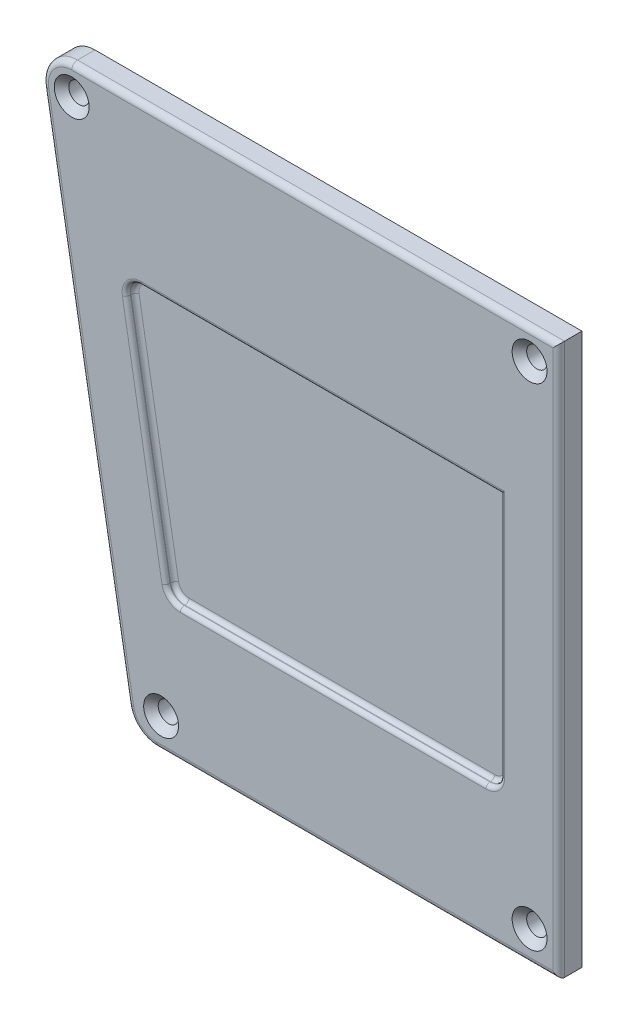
from build123d import *

# Parameters (mm, degrees)
ESQUISSE1_R                       = 3.5
BASE_EXTRUSION_DEPTH              = 8
CONG_1_R                          = 2
ENL_V_MAT_EXTRU_1_DEPTH           = 3
CONG_2_R                          = 1.4
ENL_V_MAT_EXTRU_2_DEPTH           = 3
CONG_3_R                          = 2
ESQUISSE4_R                       = 6
ENL_V_MAT_EXTRU_3_DEPTH           = 3
ENL_V_MAT_EXTRU_3_DRAFT           = -45
ENL_V_MAT_EXTRU_3_PROFILE_2_DEPTH = 3
ENL_V_MAT_EXTRU_3_PROFILE_2_DRAFT = -45
ENL_V_MAT_EXTRU_3_PROFILE_3_DEPTH = 3
ENL_V_MAT_EXTRU_3_PROFILE_3_DRAFT = -45
ENL_V_MAT_EXTRU_3_PROFILE_4_DEPTH = 3
ENL_V_MAT_EXTRU_3_PROFILE_4_DRAFT = -45


with BuildPart() as part:
    # Esquisse1 → Base-Extrusion (new body)
    with BuildSketch(Plane.XY):
        with BuildLine():
            Line((23.333648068, -2), (-114.890913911, -2))
            ThreePointArc((-114.890913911, -2), (-121.334233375, 0.352540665), (-124.745918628, 6.303273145))
            Line((-124.745918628, 6.303273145), (-153.91135665, 175.703273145))
            ThreePointArc((-153.91135665, 175.703273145), (-151.703811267, 183.843319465), (-144.056351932, 187.4))
            Line((-144.056351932, 187.4), (23.333648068, 187.4))
            Line((23.333648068, 187.4), (23.333648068, -2))
        make_face()
        with Locations((13.333648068, 8.49)):
            Circle(ESQUISSE1_R, mode=Mode.SUBTRACT)
        with Locations((-144.056351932, 177.4)):
            Circle(ESQUISSE1_R, mode=Mode.SUBTRACT)
        with Locations((-113.316351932, 8.49)):
            Circle(ESQUISSE1_R, mode=Mode.SUBTRACT)
        with Locations((13.333648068, 177.4)):
            Circle(ESQUISSE1_R, mode=Mode.SUBTRACT)
    extrude(amount=BASE_EXTRUSION_DEPTH)

    # Cong_1
    cong_1_edges = [part.edges().sort_by_distance(p)[0] for p in [
        (-151.703811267, 183.843319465, 8),
        (-139.328637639, 91.003273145, 8),
        (-121.334233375, 0.352540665, 8),
        (-45.778632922, -2, 8),
        (23.333648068, 92.7, 8),
        (-60.361351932, 187.4, 8),
    ]]
    fillet(cong_1_edges, radius=CONG_1_R)

    # Esquisse2 → Enl_v. mat.-Extru.1 (cut)
    with BuildSketch(Plane.XY.offset(8)):
        with BuildLine():
            Line((-106.729152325, 44), (-1.666351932, 44))
            ThreePointArc((-1.666351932, 44), (1.869181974, 45.464466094), (3.333648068, 49))
            Line((3.333648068, 49), (3.333648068, 133))
            Line((3.333648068, 133), (-120.330507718, 133))
            ThreePointArc((-120.330507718, 133), (-124.154237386, 131.221659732), (-125.258010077, 127.151636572))
            Line((-125.258010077, 127.151636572), (-111.656654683, 48.151636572))
            ThreePointArc((-111.656654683, 48.151636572), (-109.950812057, 45.176270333), (-106.729152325, 44))
        make_face()
    extrude(amount=-ENL_V_MAT_EXTRU_1_DEPTH, mode=Mode.SUBTRACT)

    # Cong_2
    cong_2_edges = [part.edges().sort_by_distance(p)[0] for p in [
        (3.333648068, 91, 5),
        (1.869181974, 45.464466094, 5),
        (-54.197752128, 44, 5),
        (-109.950812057, 45.176270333, 5),
        (-118.45733238, 87.651636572, 5),
        (-124.154237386, 131.221659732, 5),
        (-58.498429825, 133, 5),
        (3.333648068, 91, 8),
        (-58.498429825, 133, 8),
        (-124.154237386, 131.221659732, 8),
        (-118.45733238, 87.651636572, 8),
        (-109.950812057, 45.176270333, 8),
        (-54.197752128, 44, 8),
        (1.869181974, 45.464466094, 8),
    ]]
    fillet(cong_2_edges, radius=CONG_2_R)

    # Esquisse3 → Enl_v. mat.-Extru.2 (cut)
    with BuildSketch(Plane(origin=(0, 0, 0), x_dir=(-1, 0, 0), z_dir=(0, 0, -1))):
        with BuildLine():
            Line((1.666351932, 37), (96.951822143, 37))
            ThreePointArc((96.951822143, 37), (100.487356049, 35.535533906), (101.951822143, 32))
            Line((101.951822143, 32), (101.951822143, 14.433141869))
            ThreePointArc((101.951822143, 14.433141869), (100.487356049, 10.897607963), (96.951822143, 9.433141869))
            Line((96.951822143, 9.433141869), (1.666351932, 9.433141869))
            ThreePointArc((1.666351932, 9.433141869), (-1.869181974, 10.897607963), (-3.333648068, 14.433141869))
            Line((-3.333648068, 14.433141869), (-3.333648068, 32))
            ThreePointArc((-3.333648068, 32), (-1.869181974, 35.535533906), (1.666351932, 37))
        make_face()
        with BuildLine():
            Line((1.666351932, 167.548258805), (121.524693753, 167.548258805))
            ThreePointArc((121.524693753, 167.548258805), (125.060227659, 166.083792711), (126.524693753, 162.548258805))
            Line((126.524693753, 162.548258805), (126.524693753, 145))
            ThreePointArc((126.524693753, 145), (125.060227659, 141.464466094), (121.524693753, 140))
            Line((121.524693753, 140), (1.666351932, 140))
            ThreePointArc((1.666351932, 140), (-1.869181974, 141.464466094), (-3.333648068, 145))
            Line((-3.333648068, 145), (-3.333648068, 162.548258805))
            ThreePointArc((-3.333648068, 162.548258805), (-1.869181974, 166.083792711), (1.666351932, 167.548258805))
        make_face()
    extrude(amount=-ENL_V_MAT_EXTRU_2_DEPTH, mode=Mode.SUBTRACT)

    # Cong_3
    cong_3_edges = [part.edges().sort_by_distance(p)[0] for p in [
        (-125.060227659, 166.083792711, 3),
        (-126.524693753, 153.774129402, 3),
        (-125.060227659, 141.464466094, 3),
        (-61.595522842, 140, 3),
        (1.869181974, 141.464466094, 3),
        (3.333648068, 153.774129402, 3),
        (1.869181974, 166.083792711, 3),
        (-61.595522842, 167.548258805, 3),
        (-100.487356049, 35.535533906, 3),
        (-101.951822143, 23.216570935, 3),
        (-100.487356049, 10.897607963, 3),
        (-49.309087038, 9.433141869, 3),
        (1.869181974, 10.897607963, 3),
        (3.333648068, 23.216570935, 3),
        (1.869181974, 35.535533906, 3),
        (-49.309087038, 37, 3),
    ]]
    fillet(cong_3_edges, radius=CONG_3_R)


with BuildPart() as enl_v_mat_extru_3_tool:
    # Esquisse4 → Enl_v. mat.-Extru.3 (with draft: the straight prism first)
    with BuildSketch(Plane.XY.offset(8)):
        with Locations((-144.056351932, 177.4)):
            Circle(ESQUISSE4_R)
    extrude(amount=-ENL_V_MAT_EXTRU_3_DEPTH)
    # Enl_v. mat.-Extru.3: the draft: its side faces are tilted about the plane it starts from
    enl_v_mat_extru_3_sides = [enl_v_mat_extru_3_tool.faces().sort_by_distance(p)[0] for p in [
        (-150.056351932, 177.4, 6.5),
    ]]
    draft(enl_v_mat_extru_3_sides, Plane.XY.offset(8), ENL_V_MAT_EXTRU_3_DRAFT)


with BuildPart() as part_1:
    add(part.part)

    # Enl_v. mat.-Extru.3: cut by enl_v_mat_extru_3_tool
    add(enl_v_mat_extru_3_tool.part, mode=Mode.SUBTRACT)


with BuildPart() as enl_v_mat_extru_3_profile_2_tool:
    # Esquisse4 → Enl_v. mat.-Extru.3 profile 2 (with draft: the straight prism first)
    with BuildSketch(Plane.XY.offset(8)):
        with Locations((13.333648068, 177.4)):
            Circle(ESQUISSE4_R)
    extrude(amount=-ENL_V_MAT_EXTRU_3_PROFILE_2_DEPTH)
    # Enl_v. mat.-Extru.3 profile 2: the draft: its side faces are tilted about the plane it starts from
    enl_v_mat_extru_3_profile_2_sides = [enl_v_mat_extru_3_profile_2_tool.faces().sort_by_distance(p)[0] for p in [
        (7.333648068, 177.4, 6.5),
    ]]
    draft(enl_v_mat_extru_3_profile_2_sides, Plane.XY.offset(8), ENL_V_MAT_EXTRU_3_PROFILE_2_DRAFT)


with BuildPart() as part_2:
    add(part_1.part)

    # Enl_v. mat.-Extru.3 profile 2: cut by enl_v_mat_extru_3_profile_2_tool
    add(enl_v_mat_extru_3_profile_2_tool.part, mode=Mode.SUBTRACT)


with BuildPart() as enl_v_mat_extru_3_profile_3_tool:
    # Esquisse4 → Enl_v. mat.-Extru.3 profile 3 (with draft: the straight prism first)
    with BuildSketch(Plane.XY.offset(8)):
        with Locations((13.333648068, 8.49)):
            Circle(ESQUISSE4_R)
    extrude(amount=-ENL_V_MAT_EXTRU_3_PROFILE_3_DEPTH)
    # Enl_v. mat.-Extru.3 profile 3: the draft: its side faces are tilted about the plane it starts from
    enl_v_mat_extru_3_profile_3_sides = [enl_v_mat_extru_3_profile_3_tool.faces().sort_by_distance(p)[0] for p in [
        (7.333648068, 8.49, 6.5),
    ]]
    draft(enl_v_mat_extru_3_profile_3_sides, Plane.XY.offset(8), ENL_V_MAT_EXTRU_3_PROFILE_3_DRAFT)


with BuildPart() as part_3:
    add(part_2.part)

    # Enl_v. mat.-Extru.3 profile 3: cut by enl_v_mat_extru_3_profile_3_tool
    add(enl_v_mat_extru_3_profile_3_tool.part, mode=Mode.SUBTRACT)


with BuildPart() as enl_v_mat_extru_3_profile_4_tool:
    # Esquisse4 → Enl_v. mat.-Extru.3 profile 4 (with draft: the straight prism first)
    with BuildSketch(Plane.XY.offset(8)):
        with Locations((-113.316351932, 8.49)):
            Circle(ESQUISSE4_R)
    extrude(amount=-ENL_V_MAT_EXTRU_3_PROFILE_4_DEPTH)
    # Enl_v. mat.-Extru.3 profile 4: the draft: its side faces are tilted about the plane it starts from
    enl_v_mat_extru_3_profile_4_sides = [enl_v_mat_extru_3_profile_4_tool.faces().sort_by_distance(p)[0] for p in [
        (-119.316351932, 8.49, 6.5),
    ]]
    draft(enl_v_mat_extru_3_profile_4_sides, Plane.XY.offset(8), ENL_V_MAT_EXTRU_3_PROFILE_4_DRAFT)


with BuildPart() as part_4:
    add(part_3.part)

    # Enl_v. mat.-Extru.3 profile 4: cut by enl_v_mat_extru_3_profile_4_tool
    add(enl_v_mat_extru_3_profile_4_tool.part, mode=Mode.SUBTRACT)


solid = part_4.part
